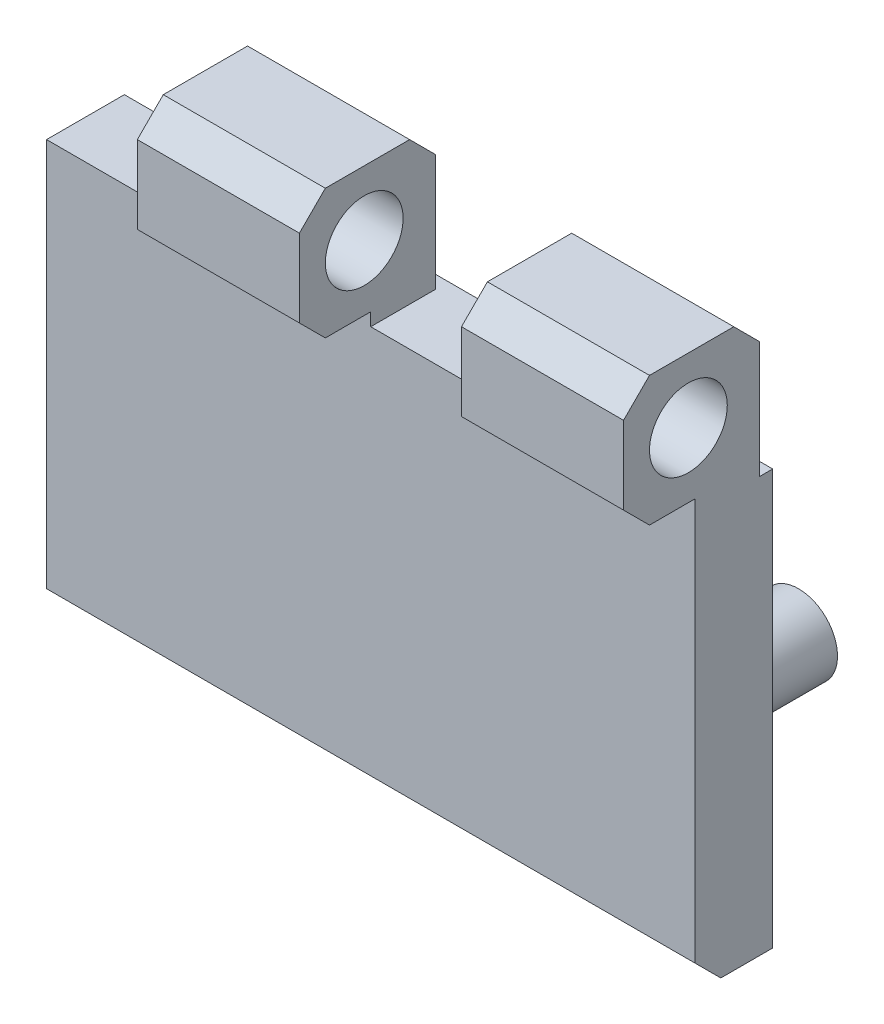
ISO-10303-21;
HEADER;
FILE_DESCRIPTION(('STEP AP214'),'2;1');
FILE_NAME('part.step','',(''),(''),'','','');
FILE_SCHEMA(('AUTOMOTIVE_DESIGN { 1 0 10303 214 1 1 1 1 }'));
ENDSEC;
DATA;
#1=APPLICATION_CONTEXT('core data for automotive mechanical design processes');
#2=APPLICATION_PROTOCOL_DEFINITION('international standard','automotive_design',2000,#1);
#3=PRODUCT_CONTEXT('',#1,'mechanical');
#4=PRODUCT('Part','Part','',(#3));
#5=PRODUCT_RELATED_PRODUCT_CATEGORY('part','',(#4));
#6=PRODUCT_DEFINITION_FORMATION('','',#4);
#7=PRODUCT_DEFINITION_CONTEXT('part definition',#1,'design');
#8=PRODUCT_DEFINITION('design','',#6,#7);
#9=PRODUCT_DEFINITION_SHAPE('','',#8);
#10=(LENGTH_UNIT() NAMED_UNIT(*) SI_UNIT(.MILLI.,.METRE.));
#11=(NAMED_UNIT(*) PLANE_ANGLE_UNIT() SI_UNIT($,.RADIAN.));
#12=(NAMED_UNIT(*) SI_UNIT($,.STERADIAN.) SOLID_ANGLE_UNIT());
#13=UNCERTAINTY_MEASURE_WITH_UNIT(LENGTH_MEASURE(1.E-05),#10,'distance_accuracy_value','');
#14=(GEOMETRIC_REPRESENTATION_CONTEXT(3) GLOBAL_UNCERTAINTY_ASSIGNED_CONTEXT((#13)) GLOBAL_UNIT_ASSIGNED_CONTEXT((#10,
#11,#12)) REPRESENTATION_CONTEXT('',''));
#15=CARTESIAN_POINT('',(0.,0.,0.));
#16=DIRECTION('',(0.,0.,1.));
#17=DIRECTION('',(1.,0.,0.));
#18=AXIS2_PLACEMENT_3D('',#15,#16,#17);
#19=CARTESIAN_POINT('',(-10.,-10.,0.));
#20=DIRECTION('',(0.,0.,-1.));
#21=DIRECTION('',(-1.,0.,0.));
#22=AXIS2_PLACEMENT_3D('',#19,#20,#21);
#23=PLANE('',#22);
#24=DIRECTION('',(0.,1.,0.));
#25=VECTOR('',#24,1.);
#26=CARTESIAN_POINT('',(-10.,-10.,0.));
#27=LINE('',#26,#25);
#28=CARTESIAN_POINT('',(-10.,-10.,0.));
#29=VERTEX_POINT('',#28);
#30=CARTESIAN_POINT('',(-10.,22.,0.));
#31=VERTEX_POINT('',#30);
#32=EDGE_CURVE('E315',#29,#31,#27,.T.);
#33=ORIENTED_EDGE('',*,*,#32,.T.);
#34=DIRECTION('',(1.,0.,0.));
#35=VECTOR('',#34,1.);
#36=CARTESIAN_POINT('',(-10.,22.,0.));
#37=LINE('',#36,#35);
#38=CARTESIAN_POINT('',(40.,22.,0.));
#39=VERTEX_POINT('',#38);
#40=EDGE_CURVE('E320',#31,#39,#37,.T.);
#41=ORIENTED_EDGE('',*,*,#40,.T.);
#42=DIRECTION('',(0.,1.,0.));
#43=VECTOR('',#42,1.);
#44=CARTESIAN_POINT('',(40.,-10.,0.));
#45=LINE('',#44,#43);
#46=CARTESIAN_POINT('',(40.,-10.,0.));
#47=VERTEX_POINT('',#46);
#48=EDGE_CURVE('E303',#47,#39,#45,.T.);
#49=ORIENTED_EDGE('',*,*,#48,.F.);
#50=DIRECTION('',(1.,0.,0.));
#51=VECTOR('',#50,1.);
#52=CARTESIAN_POINT('',(-10.,-10.,0.));
#53=LINE('',#52,#51);
#54=EDGE_CURVE('E318',#29,#47,#53,.T.);
#55=ORIENTED_EDGE('',*,*,#54,.F.);
#56=EDGE_LOOP('',(#33,#41,#49,#55));
#57=FACE_BOUND('',#56,.T.);
#58=CARTESIAN_POINT('',(30.,0.,0.));
#59=DIRECTION('',(0.,0.,-1.));
#60=DIRECTION('',(-1.,0.,0.));
#61=AXIS2_PLACEMENT_3D('',#58,#59,#60);
#62=CIRCLE('',#61,3.);
#63=CARTESIAN_POINT('',(27.,0.,0.));
#64=VERTEX_POINT('',#63);
#65=EDGE_CURVE('E10',#64,#64,#62,.T.);
#66=ORIENTED_EDGE('',*,*,#65,.F.);
#67=EDGE_LOOP('',(#66));
#68=FACE_BOUND('',#67,.T.);
#69=CARTESIAN_POINT('',(0.,0.,0.));
#70=DIRECTION('',(0.,0.,-1.));
#71=DIRECTION('',(-1.,0.,0.));
#72=AXIS2_PLACEMENT_3D('',#69,#70,#71);
#73=CIRCLE('',#72,3.);
#74=CARTESIAN_POINT('',(-3.,0.,0.));
#75=VERTEX_POINT('',#74);
#76=EDGE_CURVE('E234',#75,#75,#73,.T.);
#77=ORIENTED_EDGE('',*,*,#76,.F.);
#78=EDGE_LOOP('',(#77));
#79=FACE_BOUND('',#78,.T.);
#80=ADVANCED_FACE('F16',(#57,#68,#79),#23,.T.);
#81=CARTESIAN_POINT('',(-10.,-10.,6.));
#82=DIRECTION('',(0.,0.,-1.));
#83=DIRECTION('',(-1.,0.,0.));
#84=AXIS2_PLACEMENT_3D('',#81,#82,#83);
#85=PLANE('',#84);
#86=DIRECTION('',(0.,1.,0.));
#87=VECTOR('',#86,1.);
#88=CARTESIAN_POINT('',(27.5,-10.,6.));
#89=LINE('',#88,#87);
#90=CARTESIAN_POINT('',(27.5,22.,6.));
#91=VERTEX_POINT('',#90);
#92=CARTESIAN_POINT('',(27.5,23.,6.));
#93=VERTEX_POINT('',#92);
#94=EDGE_CURVE('E278',#91,#93,#89,.T.);
#95=ORIENTED_EDGE('',*,*,#94,.F.);
#96=DIRECTION('',(-1.,0.,0.));
#97=VECTOR('',#96,1.);
#98=CARTESIAN_POINT('',(-10.,22.,6.));
#99=LINE('',#98,#97);
#100=CARTESIAN_POINT('',(15.,22.,6.));
#101=VERTEX_POINT('',#100);
#102=EDGE_CURVE('E283',#91,#101,#99,.T.);
#103=ORIENTED_EDGE('',*,*,#102,.T.);
#104=DIRECTION('',(0.,1.,0.));
#105=VECTOR('',#104,1.);
#106=CARTESIAN_POINT('',(15.,-10.,6.));
#107=LINE('',#106,#105);
#108=CARTESIAN_POINT('',(15.,23.,6.));
#109=VERTEX_POINT('',#108);
#110=EDGE_CURVE('E268',#101,#109,#107,.T.);
#111=ORIENTED_EDGE('',*,*,#110,.T.);
#112=DIRECTION('',(1.,0.,0.));
#113=VECTOR('',#112,1.);
#114=CARTESIAN_POINT('',(-10.,23.,6.));
#115=LINE('',#114,#113);
#116=CARTESIAN_POINT('',(2.5,23.,6.));
#117=VERTEX_POINT('',#116);
#118=EDGE_CURVE('E327',#117,#109,#115,.T.);
#119=ORIENTED_EDGE('',*,*,#118,.F.);
#120=DIRECTION('',(0.,1.,0.));
#121=VECTOR('',#120,1.);
#122=CARTESIAN_POINT('',(2.5,-10.,6.));
#123=LINE('',#122,#121);
#124=CARTESIAN_POINT('',(2.5,22.,6.));
#125=VERTEX_POINT('',#124);
#126=EDGE_CURVE('E261',#125,#117,#123,.T.);
#127=ORIENTED_EDGE('',*,*,#126,.F.);
#128=DIRECTION('',(-1.,0.,0.));
#129=VECTOR('',#128,1.);
#130=CARTESIAN_POINT('',(-10.,22.,6.));
#131=LINE('',#130,#129);
#132=CARTESIAN_POINT('',(-10.,22.,6.));
#133=VERTEX_POINT('',#132);
#134=EDGE_CURVE('E280',#125,#133,#131,.T.);
#135=ORIENTED_EDGE('',*,*,#134,.T.);
#136=DIRECTION('',(0.,1.,0.));
#137=VECTOR('',#136,1.);
#138=CARTESIAN_POINT('',(-10.,-10.,6.));
#139=LINE('',#138,#137);
#140=CARTESIAN_POINT('',(-10.,-8.,6.));
#141=VERTEX_POINT('',#140);
#142=EDGE_CURVE('E309',#141,#133,#139,.T.);
#143=ORIENTED_EDGE('',*,*,#142,.F.);
#144=DIRECTION('',(1.,0.,0.));
#145=VECTOR('',#144,1.);
#146=CARTESIAN_POINT('',(-10.,-8.,6.));
#147=LINE('',#146,#145);
#148=CARTESIAN_POINT('',(40.,-8.,6.));
#149=VERTEX_POINT('',#148);
#150=EDGE_CURVE('E328',#141,#149,#147,.T.);
#151=ORIENTED_EDGE('',*,*,#150,.T.);
#152=DIRECTION('',(0.,1.,0.));
#153=VECTOR('',#152,1.);
#154=CARTESIAN_POINT('',(40.,-10.,6.));
#155=LINE('',#154,#153);
#156=CARTESIAN_POINT('',(40.,23.,6.));
#157=VERTEX_POINT('',#156);
#158=EDGE_CURVE('E289',#149,#157,#155,.T.);
#159=ORIENTED_EDGE('',*,*,#158,.T.);
#160=EDGE_CURVE('E325',#93,#157,#115,.T.);
#161=ORIENTED_EDGE('',*,*,#160,.F.);
#162=EDGE_LOOP('',(#95,#103,#111,#119,#127,#135,#143,#151,#159,#161));
#163=FACE_BOUND('',#162,.T.);
#164=ADVANCED_FACE('F18',(#163),#85,.F.);
#165=CARTESIAN_POINT('',(-10.,23.,11.));
#166=DIRECTION('',(0.,-1.,0.));
#167=DIRECTION('',(1.,0.,0.));
#168=AXIS2_PLACEMENT_3D('',#165,#166,#167);
#169=PLANE('',#168);
#170=DIRECTION('',(0.,0.,-1.));
#171=VECTOR('',#170,1.);
#172=CARTESIAN_POINT('',(40.,23.,11.));
#173=LINE('',#172,#171);
#174=CARTESIAN_POINT('',(40.,23.,9.5));
#175=VERTEX_POINT('',#174);
#176=EDGE_CURVE('E292',#175,#157,#173,.T.);
#177=ORIENTED_EDGE('',*,*,#176,.F.);
#178=DIRECTION('',(1.,0.,0.));
#179=VECTOR('',#178,1.);
#180=CARTESIAN_POINT('',(27.5,23.,9.5));
#181=LINE('',#180,#179);
#182=CARTESIAN_POINT('',(27.5,23.,9.5));
#183=VERTEX_POINT('',#182);
#184=EDGE_CURVE('E231',#183,#175,#181,.T.);
#185=ORIENTED_EDGE('',*,*,#184,.F.);
#186=DIRECTION('',(0.,0.,-1.));
#187=VECTOR('',#186,1.);
#188=CARTESIAN_POINT('',(27.5,23.,11.));
#189=LINE('',#188,#187);
#190=EDGE_CURVE('E275',#183,#93,#189,.T.);
#191=ORIENTED_EDGE('',*,*,#190,.T.);
#192=ORIENTED_EDGE('',*,*,#160,.T.);
#193=EDGE_LOOP('',(#177,#185,#191,#192));
#194=FACE_BOUND('',#193,.T.);
#195=ADVANCED_FACE('F382',(#194),#169,.T.);
#196=DIRECTION('',(0.,0.,-1.));
#197=VECTOR('',#196,1.);
#198=CARTESIAN_POINT('',(15.,23.,11.));
#199=LINE('',#198,#197);
#200=CARTESIAN_POINT('',(15.,23.,9.5));
#201=VERTEX_POINT('',#200);
#202=EDGE_CURVE('E266',#201,#109,#199,.T.);
#203=ORIENTED_EDGE('',*,*,#202,.F.);
#204=DIRECTION('',(1.,0.,0.));
#205=VECTOR('',#204,1.);
#206=CARTESIAN_POINT('',(2.5,23.,9.5));
#207=LINE('',#206,#205);
#208=CARTESIAN_POINT('',(2.5,23.,9.5));
#209=VERTEX_POINT('',#208);
#210=EDGE_CURVE('E206',#209,#201,#207,.T.);
#211=ORIENTED_EDGE('',*,*,#210,.F.);
#212=DIRECTION('',(0.,0.,-1.));
#213=VECTOR('',#212,1.);
#214=CARTESIAN_POINT('',(2.5,23.,11.));
#215=LINE('',#214,#213);
#216=EDGE_CURVE('E174',#209,#117,#215,.T.);
#217=ORIENTED_EDGE('',*,*,#216,.T.);
#218=ORIENTED_EDGE('',*,*,#118,.T.);
#219=EDGE_LOOP('',(#203,#211,#217,#218));
#220=FACE_BOUND('',#219,.T.);
#221=ADVANCED_FACE('F432',(#220),#169,.T.);
#222=CARTESIAN_POINT('',(-10.,33.,1.));
#223=DIRECTION('',(0.,1.,0.));
#224=DIRECTION('',(-1.,0.,0.));
#225=AXIS2_PLACEMENT_3D('',#222,#223,#224);
#226=PLANE('',#225);
#227=DIRECTION('',(-1.,0.,0.));
#228=VECTOR('',#227,1.);
#229=CARTESIAN_POINT('',(-10.,33.,3.));
#230=LINE('',#229,#228);
#231=CARTESIAN_POINT('',(40.,33.,3.));
#232=VERTEX_POINT('',#231);
#233=CARTESIAN_POINT('',(27.5,33.,3.));
#234=VERTEX_POINT('',#233);
#235=EDGE_CURVE('E339',#232,#234,#230,.T.);
#236=ORIENTED_EDGE('',*,*,#235,.T.);
#237=DIRECTION('',(0.,0.,1.));
#238=VECTOR('',#237,1.);
#239=CARTESIAN_POINT('',(27.5,33.,1.));
#240=LINE('',#239,#238);
#241=CARTESIAN_POINT('',(27.5,33.,9.5));
#242=VERTEX_POINT('',#241);
#243=EDGE_CURVE('E273',#234,#242,#240,.T.);
#244=ORIENTED_EDGE('',*,*,#243,.T.);
#245=DIRECTION('',(1.,0.,0.));
#246=VECTOR('',#245,1.);
#247=CARTESIAN_POINT('',(27.5,33.,9.5));
#248=LINE('',#247,#246);
#249=CARTESIAN_POINT('',(40.,33.,9.5));
#250=VERTEX_POINT('',#249);
#251=EDGE_CURVE('E223',#242,#250,#248,.T.);
#252=ORIENTED_EDGE('',*,*,#251,.T.);
#253=DIRECTION('',(0.,0.,1.));
#254=VECTOR('',#253,1.);
#255=CARTESIAN_POINT('',(40.,33.,1.));
#256=LINE('',#255,#254);
#257=EDGE_CURVE('E295',#232,#250,#256,.T.);
#258=ORIENTED_EDGE('',*,*,#257,.F.);
#259=EDGE_LOOP('',(#236,#244,#252,#258));
#260=FACE_BOUND('',#259,.T.);
#261=ADVANCED_FACE('F358',(#260),#226,.T.);
#262=DIRECTION('',(0.,0.,1.));
#263=VECTOR('',#262,1.);
#264=CARTESIAN_POINT('',(15.,33.,1.));
#265=LINE('',#264,#263);
#266=CARTESIAN_POINT('',(15.,33.,3.));
#267=VERTEX_POINT('',#266);
#268=CARTESIAN_POINT('',(15.,33.,9.5));
#269=VERTEX_POINT('',#268);
#270=EDGE_CURVE('E264',#267,#269,#265,.T.);
#271=ORIENTED_EDGE('',*,*,#270,.F.);
#272=CARTESIAN_POINT('',(2.5,33.,3.));
#273=VERTEX_POINT('',#272);
#274=EDGE_CURVE('E173',#267,#273,#230,.T.);
#275=ORIENTED_EDGE('',*,*,#274,.T.);
#276=DIRECTION('',(0.,0.,1.));
#277=VECTOR('',#276,1.);
#278=CARTESIAN_POINT('',(2.5,33.,1.));
#279=LINE('',#278,#277);
#280=CARTESIAN_POINT('',(2.5,33.,9.5));
#281=VERTEX_POINT('',#280);
#282=EDGE_CURVE('E41',#273,#281,#279,.T.);
#283=ORIENTED_EDGE('',*,*,#282,.T.);
#284=DIRECTION('',(1.,0.,0.));
#285=VECTOR('',#284,1.);
#286=CARTESIAN_POINT('',(2.5,33.,9.5));
#287=LINE('',#286,#285);
#288=EDGE_CURVE('E170',#281,#269,#287,.T.);
#289=ORIENTED_EDGE('',*,*,#288,.T.);
#290=EDGE_LOOP('',(#271,#275,#283,#289));
#291=FACE_BOUND('',#290,.T.);
#292=ADVANCED_FACE('F169',(#291),#226,.T.);
#293=CARTESIAN_POINT('',(-10.,33.,1.));
#294=DIRECTION('',(0.,0.,1.));
#295=DIRECTION('',(0.,-1.,0.));
#296=AXIS2_PLACEMENT_3D('',#293,#294,#295);
#297=PLANE('',#296);
#298=DIRECTION('',(0.,-1.,0.));
#299=VECTOR('',#298,1.);
#300=CARTESIAN_POINT('',(27.5,33.,1.));
#301=LINE('',#300,#299);
#302=CARTESIAN_POINT('',(27.5,31.,1.));
#303=VERTEX_POINT('',#302);
#304=CARTESIAN_POINT('',(27.5,22.,1.));
#305=VERTEX_POINT('',#304);
#306=EDGE_CURVE('E271',#303,#305,#301,.T.);
#307=ORIENTED_EDGE('',*,*,#306,.F.);
#308=DIRECTION('',(1.,0.,0.));
#309=VECTOR('',#308,1.);
#310=CARTESIAN_POINT('',(40.,31.,1.));
#311=LINE('',#310,#309);
#312=CARTESIAN_POINT('',(40.,31.,1.));
#313=VERTEX_POINT('',#312);
#314=EDGE_CURVE('E342',#303,#313,#311,.T.);
#315=ORIENTED_EDGE('',*,*,#314,.T.);
#316=DIRECTION('',(0.,-1.,0.));
#317=VECTOR('',#316,1.);
#318=CARTESIAN_POINT('',(40.,33.,1.));
#319=LINE('',#318,#317);
#320=CARTESIAN_POINT('',(40.,22.,1.));
#321=VERTEX_POINT('',#320);
#322=EDGE_CURVE('E297',#313,#321,#319,.T.);
#323=ORIENTED_EDGE('',*,*,#322,.T.);
#324=DIRECTION('',(1.,0.,0.));
#325=VECTOR('',#324,1.);
#326=CARTESIAN_POINT('',(-10.,22.,1.));
#327=LINE('',#326,#325);
#328=EDGE_CURVE('E322',#305,#321,#327,.T.);
#329=ORIENTED_EDGE('',*,*,#328,.F.);
#330=EDGE_LOOP('',(#307,#315,#323,#329));
#331=FACE_BOUND('',#330,.T.);
#332=ADVANCED_FACE('F367',(#331),#297,.F.);
#333=CARTESIAN_POINT('',(2.5,31.,1.));
#334=VERTEX_POINT('',#333);
#335=CARTESIAN_POINT('',(15.,31.,1.));
#336=VERTEX_POINT('',#335);
#337=EDGE_CURVE('E344',#334,#336,#311,.T.);
#338=ORIENTED_EDGE('',*,*,#337,.T.);
#339=DIRECTION('',(0.,-1.,0.));
#340=VECTOR('',#339,1.);
#341=CARTESIAN_POINT('',(15.,33.,1.));
#342=LINE('',#341,#340);
#343=CARTESIAN_POINT('',(15.,22.,1.));
#344=VERTEX_POINT('',#343);
#345=EDGE_CURVE('E33',#336,#344,#342,.T.);
#346=ORIENTED_EDGE('',*,*,#345,.T.);
#347=CARTESIAN_POINT('',(2.5,22.,1.));
#348=VERTEX_POINT('',#347);
#349=EDGE_CURVE('E324',#348,#344,#327,.T.);
#350=ORIENTED_EDGE('',*,*,#349,.F.);
#351=DIRECTION('',(0.,-1.,0.));
#352=VECTOR('',#351,1.);
#353=CARTESIAN_POINT('',(2.5,33.,1.));
#354=LINE('',#353,#352);
#355=EDGE_CURVE('E175',#334,#348,#354,.T.);
#356=ORIENTED_EDGE('',*,*,#355,.F.);
#357=EDGE_LOOP('',(#338,#346,#350,#356));
#358=FACE_BOUND('',#357,.T.);
#359=ADVANCED_FACE('F430',(#358),#297,.F.);
#360=CARTESIAN_POINT('',(-10.,31.,1.));
#361=DIRECTION('',(0.,0.707106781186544,-0.707106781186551));
#362=DIRECTION('',(0.,0.707106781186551,0.707106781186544));
#363=AXIS2_PLACEMENT_3D('',#360,#361,#362);
#364=PLANE('',#363);
#365=ORIENTED_EDGE('',*,*,#314,.F.);
#366=DIRECTION('',(0.,0.707106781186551,0.707106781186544));
#367=VECTOR('',#366,1.);
#368=CARTESIAN_POINT('',(27.5,31.,1.));
#369=LINE('',#368,#367);
#370=EDGE_CURVE('E25',#303,#234,#369,.T.);
#371=ORIENTED_EDGE('',*,*,#370,.T.);
#372=ORIENTED_EDGE('',*,*,#235,.F.);
#373=DIRECTION('',(0.,0.707106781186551,0.707106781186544));
#374=VECTOR('',#373,1.);
#375=CARTESIAN_POINT('',(40.,31.,1.));
#376=LINE('',#375,#374);
#377=EDGE_CURVE('E331',#313,#232,#376,.T.);
#378=ORIENTED_EDGE('',*,*,#377,.F.);
#379=EDGE_LOOP('',(#365,#371,#372,#378));
#380=FACE_BOUND('',#379,.T.);
#381=ADVANCED_FACE('F352',(#380),#364,.T.);
#382=DIRECTION('',(0.,0.707106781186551,0.707106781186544));
#383=VECTOR('',#382,1.);
#384=CARTESIAN_POINT('',(15.,31.,1.));
#385=LINE('',#384,#383);
#386=EDGE_CURVE('E347',#336,#267,#385,.T.);
#387=ORIENTED_EDGE('',*,*,#386,.F.);
#388=ORIENTED_EDGE('',*,*,#337,.F.);
#389=DIRECTION('',(0.,0.707106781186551,0.707106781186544));
#390=VECTOR('',#389,1.);
#391=CARTESIAN_POINT('',(2.5,31.,1.));
#392=LINE('',#391,#390);
#393=EDGE_CURVE('E345',#334,#273,#392,.T.);
#394=ORIENTED_EDGE('',*,*,#393,.T.);
#395=ORIENTED_EDGE('',*,*,#274,.F.);
#396=EDGE_LOOP('',(#387,#388,#394,#395));
#397=FACE_BOUND('',#396,.T.);
#398=ADVANCED_FACE('F458',(#397),#364,.T.);
#399=CARTESIAN_POINT('',(-10.,-10.,0.));
#400=DIRECTION('',(0.,1.,0.));
#401=DIRECTION('',(-1.,0.,0.));
#402=AXIS2_PLACEMENT_3D('',#399,#400,#401);
#403=PLANE('',#402);
#404=DIRECTION('',(0.,0.,1.));
#405=VECTOR('',#404,1.);
#406=CARTESIAN_POINT('',(40.,-10.,0.));
#407=LINE('',#406,#405);
#408=CARTESIAN_POINT('',(40.,-10.,4.));
#409=VERTEX_POINT('',#408);
#410=EDGE_CURVE('E286',#47,#409,#407,.T.);
#411=ORIENTED_EDGE('',*,*,#410,.T.);
#412=DIRECTION('',(-1.,0.,0.));
#413=VECTOR('',#412,1.);
#414=CARTESIAN_POINT('',(-10.,-10.,4.));
#415=LINE('',#414,#413);
#416=CARTESIAN_POINT('',(-10.,-10.,4.));
#417=VERTEX_POINT('',#416);
#418=EDGE_CURVE('E335',#409,#417,#415,.T.);
#419=ORIENTED_EDGE('',*,*,#418,.T.);
#420=DIRECTION('',(0.,0.,1.));
#421=VECTOR('',#420,1.);
#422=CARTESIAN_POINT('',(-10.,-10.,0.));
#423=LINE('',#422,#421);
#424=EDGE_CURVE('E306',#29,#417,#423,.T.);
#425=ORIENTED_EDGE('',*,*,#424,.F.);
#426=ORIENTED_EDGE('',*,*,#54,.T.);
#427=EDGE_LOOP('',(#411,#419,#425,#426));
#428=FACE_BOUND('',#427,.T.);
#429=ADVANCED_FACE('F402',(#428),#403,.F.);
#430=CARTESIAN_POINT('',(-10.,22.,1.));
#431=DIRECTION('',(0.,-1.,0.));
#432=DIRECTION('',(0.,0.,-1.));
#433=AXIS2_PLACEMENT_3D('',#430,#431,#432);
#434=PLANE('',#433);
#435=DIRECTION('',(0.,0.,-1.));
#436=VECTOR('',#435,1.);
#437=CARTESIAN_POINT('',(-10.,22.,1.));
#438=LINE('',#437,#436);
#439=EDGE_CURVE('E312',#133,#31,#438,.T.);
#440=ORIENTED_EDGE('',*,*,#439,.F.);
#441=ORIENTED_EDGE('',*,*,#134,.F.);
#442=DIRECTION('',(0.,0.,1.));
#443=VECTOR('',#442,1.);
#444=CARTESIAN_POINT('',(2.5,22.,-9.));
#445=LINE('',#444,#443);
#446=EDGE_CURVE('E249',#348,#125,#445,.T.);
#447=ORIENTED_EDGE('',*,*,#446,.F.);
#448=ORIENTED_EDGE('',*,*,#349,.T.);
#449=DIRECTION('',(0.,0.,1.));
#450=VECTOR('',#449,1.);
#451=CARTESIAN_POINT('',(15.,22.,-9.));
#452=LINE('',#451,#450);
#453=EDGE_CURVE('E252',#344,#101,#452,.T.);
#454=ORIENTED_EDGE('',*,*,#453,.T.);
#455=ORIENTED_EDGE('',*,*,#102,.F.);
#456=DIRECTION('',(0.,0.,1.));
#457=VECTOR('',#456,1.);
#458=CARTESIAN_POINT('',(27.5,22.,-9.));
#459=LINE('',#458,#457);
#460=EDGE_CURVE('E255',#305,#91,#459,.T.);
#461=ORIENTED_EDGE('',*,*,#460,.F.);
#462=ORIENTED_EDGE('',*,*,#328,.T.);
#463=DIRECTION('',(0.,0.,-1.));
#464=VECTOR('',#463,1.);
#465=CARTESIAN_POINT('',(40.,22.,1.));
#466=LINE('',#465,#464);
#467=EDGE_CURVE('E300',#321,#39,#466,.T.);
#468=ORIENTED_EDGE('',*,*,#467,.T.);
#469=ORIENTED_EDGE('',*,*,#40,.F.);
#470=EDGE_LOOP('',(#440,#441,#447,#448,#454,#455,#461,#462,#468,#469));
#471=FACE_BOUND('',#470,.T.);
#472=ADVANCED_FACE('F373',(#471),#434,.F.);
#473=CARTESIAN_POINT('',(-10.,-10.,6.));
#474=DIRECTION('',(-1.,0.,0.));
#475=DIRECTION('',(0.,-1.,0.));
#476=AXIS2_PLACEMENT_3D('',#473,#474,#475);
#477=PLANE('',#476);
#478=ORIENTED_EDGE('',*,*,#142,.T.);
#479=ORIENTED_EDGE('',*,*,#439,.T.);
#480=ORIENTED_EDGE('',*,*,#32,.F.);
#481=ORIENTED_EDGE('',*,*,#424,.T.);
#482=DIRECTION('',(0.,-0.707106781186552,-0.707106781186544));
#483=VECTOR('',#482,1.);
#484=CARTESIAN_POINT('',(-10.,-9.,5.));
#485=LINE('',#484,#483);
#486=EDGE_CURVE('E337',#417,#141,#485,.F.);
#487=ORIENTED_EDGE('',*,*,#486,.T.);
#488=EDGE_LOOP('',(#478,#479,#480,#481,#487));
#489=FACE_BOUND('',#488,.T.);
#490=ADVANCED_FACE('F408',(#489),#477,.T.);
#491=CARTESIAN_POINT('',(40.,-10.,6.));
#492=DIRECTION('',(-1.,0.,0.));
#493=DIRECTION('',(0.,-1.,0.));
#494=AXIS2_PLACEMENT_3D('',#491,#492,#493);
#495=PLANE('',#494);
#496=CARTESIAN_POINT('',(40.,28.,6.5));
#497=DIRECTION('',(1.,0.,0.));
#498=DIRECTION('',(0.,0.,-1.));
#499=AXIS2_PLACEMENT_3D('',#496,#497,#498);
#500=CIRCLE('',#499,3.);
#501=CARTESIAN_POINT('',(40.,28.,3.5));
#502=VERTEX_POINT('',#501);
#503=EDGE_CURVE('E535',#502,#502,#500,.T.);
#504=ORIENTED_EDGE('',*,*,#503,.F.);
#505=EDGE_LOOP('',(#504));
#506=FACE_BOUND('',#505,.T.);
#507=ORIENTED_EDGE('',*,*,#257,.T.);
#508=DIRECTION('',(0.,-0.707106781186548,0.707106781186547));
#509=VECTOR('',#508,1.);
#510=CARTESIAN_POINT('',(40.,33.,9.5));
#511=LINE('',#510,#509);
#512=CARTESIAN_POINT('',(40.,31.,11.5));
#513=VERTEX_POINT('',#512);
#514=EDGE_CURVE('E209',#250,#513,#511,.T.);
#515=ORIENTED_EDGE('',*,*,#514,.T.);
#516=DIRECTION('',(0.,-1.,0.));
#517=VECTOR('',#516,1.);
#518=CARTESIAN_POINT('',(40.,25.,11.5));
#519=LINE('',#518,#517);
#520=CARTESIAN_POINT('',(40.,25.,11.5));
#521=VERTEX_POINT('',#520);
#522=EDGE_CURVE('E226',#513,#521,#519,.T.);
#523=ORIENTED_EDGE('',*,*,#522,.T.);
#524=DIRECTION('',(0.,-0.707106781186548,-0.707106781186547));
#525=VECTOR('',#524,1.);
#526=CARTESIAN_POINT('',(40.,25.,11.5));
#527=LINE('',#526,#525);
#528=EDGE_CURVE('E217',#521,#175,#527,.T.);
#529=ORIENTED_EDGE('',*,*,#528,.T.);
#530=ORIENTED_EDGE('',*,*,#176,.T.);
#531=ORIENTED_EDGE('',*,*,#158,.F.);
#532=DIRECTION('',(0.,0.707106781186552,0.707106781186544));
#533=VECTOR('',#532,1.);
#534=CARTESIAN_POINT('',(40.,-8.,6.));
#535=LINE('',#534,#533);
#536=EDGE_CURVE('E333',#149,#409,#535,.F.);
#537=ORIENTED_EDGE('',*,*,#536,.T.);
#538=ORIENTED_EDGE('',*,*,#410,.F.);
#539=ORIENTED_EDGE('',*,*,#48,.T.);
#540=ORIENTED_EDGE('',*,*,#467,.F.);
#541=ORIENTED_EDGE('',*,*,#322,.F.);
#542=ORIENTED_EDGE('',*,*,#377,.T.);
#543=EDGE_LOOP('',(#507,#515,#523,#529,#530,#531,#537,#538,#539,#540,#541,#542));
#544=FACE_BOUND('',#543,.T.);
#545=ADVANCED_FACE('F362',(#506,#544),#495,.F.);
#546=CARTESIAN_POINT('',(-10.,-8.,6.));
#547=DIRECTION('',(0.,0.707106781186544,-0.707106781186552));
#548=DIRECTION('',(0.,0.707106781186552,0.707106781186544));
#549=AXIS2_PLACEMENT_3D('',#546,#547,#548);
#550=PLANE('',#549);
#551=ORIENTED_EDGE('',*,*,#486,.F.);
#552=ORIENTED_EDGE('',*,*,#418,.F.);
#553=ORIENTED_EDGE('',*,*,#536,.F.);
#554=ORIENTED_EDGE('',*,*,#150,.F.);
#555=EDGE_LOOP('',(#551,#552,#553,#554));
#556=FACE_BOUND('',#555,.T.);
#557=ADVANCED_FACE('F397',(#556),#550,.F.);
#558=CARTESIAN_POINT('',(2.5,48.,-9.));
#559=DIRECTION('',(-1.,0.,0.));
#560=DIRECTION('',(0.,-1.,0.));
#561=AXIS2_PLACEMENT_3D('',#558,#559,#560);
#562=PLANE('',#561);
#563=CARTESIAN_POINT('',(2.5,28.,6.5));
#564=DIRECTION('',(-1.,0.,0.));
#565=DIRECTION('',(0.,0.,1.));
#566=AXIS2_PLACEMENT_3D('',#563,#564,#565);
#567=CIRCLE('',#566,3.);
#568=CARTESIAN_POINT('',(2.5,28.,9.5));
#569=VERTEX_POINT('',#568);
#570=EDGE_CURVE('E198',#569,#569,#567,.T.);
#571=ORIENTED_EDGE('',*,*,#570,.F.);
#572=EDGE_LOOP('',(#571));
#573=FACE_BOUND('',#572,.T.);
#574=DIRECTION('',(0.,-0.707106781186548,0.707106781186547));
#575=VECTOR('',#574,1.);
#576=CARTESIAN_POINT('',(2.5,33.,9.5));
#577=LINE('',#576,#575);
#578=CARTESIAN_POINT('',(2.5,31.,11.5));
#579=VERTEX_POINT('',#578);
#580=EDGE_CURVE('E180',#281,#579,#577,.T.);
#581=ORIENTED_EDGE('',*,*,#580,.F.);
#582=ORIENTED_EDGE('',*,*,#282,.F.);
#583=ORIENTED_EDGE('',*,*,#393,.F.);
#584=ORIENTED_EDGE('',*,*,#355,.T.);
#585=ORIENTED_EDGE('',*,*,#446,.T.);
#586=ORIENTED_EDGE('',*,*,#126,.T.);
#587=ORIENTED_EDGE('',*,*,#216,.F.);
#588=DIRECTION('',(0.,-0.707106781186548,-0.707106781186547));
#589=VECTOR('',#588,1.);
#590=CARTESIAN_POINT('',(2.5,25.,11.5));
#591=LINE('',#590,#589);
#592=CARTESIAN_POINT('',(2.5,25.,11.5));
#593=VERTEX_POINT('',#592);
#594=EDGE_CURVE('E184',#593,#209,#591,.T.);
#595=ORIENTED_EDGE('',*,*,#594,.F.);
#596=DIRECTION('',(0.,-1.,0.));
#597=VECTOR('',#596,1.);
#598=CARTESIAN_POINT('',(2.5,31.,11.5));
#599=LINE('',#598,#597);
#600=EDGE_CURVE('E190',#579,#593,#599,.T.);
#601=ORIENTED_EDGE('',*,*,#600,.F.);
#602=EDGE_LOOP('',(#581,#582,#583,#584,#585,#586,#587,#595,#601));
#603=FACE_BOUND('',#602,.T.);
#604=ADVANCED_FACE('F187',(#573,#603),#562,.T.);
#605=CARTESIAN_POINT('',(27.5,48.,-9.));
#606=DIRECTION('',(-1.,0.,0.));
#607=DIRECTION('',(0.,-1.,0.));
#608=AXIS2_PLACEMENT_3D('',#605,#606,#607);
#609=PLANE('',#608);
#610=CARTESIAN_POINT('',(27.5,28.,6.5));
#611=DIRECTION('',(-1.,0.,0.));
#612=DIRECTION('',(0.,0.,1.));
#613=AXIS2_PLACEMENT_3D('',#610,#611,#612);
#614=CIRCLE('',#613,3.);
#615=CARTESIAN_POINT('',(27.5,28.,9.5));
#616=VERTEX_POINT('',#615);
#617=EDGE_CURVE('E532',#616,#616,#614,.T.);
#618=ORIENTED_EDGE('',*,*,#617,.F.);
#619=EDGE_LOOP('',(#618));
#620=FACE_BOUND('',#619,.T.);
#621=DIRECTION('',(0.,-0.707106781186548,0.707106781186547));
#622=VECTOR('',#621,1.);
#623=CARTESIAN_POINT('',(27.5,33.,9.5));
#624=LINE('',#623,#622);
#625=CARTESIAN_POINT('',(27.5,31.,11.5));
#626=VERTEX_POINT('',#625);
#627=EDGE_CURVE('E213',#242,#626,#624,.T.);
#628=ORIENTED_EDGE('',*,*,#627,.F.);
#629=ORIENTED_EDGE('',*,*,#243,.F.);
#630=ORIENTED_EDGE('',*,*,#370,.F.);
#631=ORIENTED_EDGE('',*,*,#306,.T.);
#632=ORIENTED_EDGE('',*,*,#460,.T.);
#633=ORIENTED_EDGE('',*,*,#94,.T.);
#634=ORIENTED_EDGE('',*,*,#190,.F.);
#635=DIRECTION('',(0.,-0.707106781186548,-0.707106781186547));
#636=VECTOR('',#635,1.);
#637=CARTESIAN_POINT('',(27.5,25.,11.5));
#638=LINE('',#637,#636);
#639=CARTESIAN_POINT('',(27.5,25.,11.5));
#640=VERTEX_POINT('',#639);
#641=EDGE_CURVE('E220',#640,#183,#638,.T.);
#642=ORIENTED_EDGE('',*,*,#641,.F.);
#643=DIRECTION('',(0.,-1.,0.));
#644=VECTOR('',#643,1.);
#645=CARTESIAN_POINT('',(27.5,25.,11.5));
#646=LINE('',#645,#644);
#647=EDGE_CURVE('E216',#626,#640,#646,.T.);
#648=ORIENTED_EDGE('',*,*,#647,.F.);
#649=EDGE_LOOP('',(#628,#629,#630,#631,#632,#633,#634,#642,#648));
#650=FACE_BOUND('',#649,.T.);
#651=ADVANCED_FACE('F370',(#620,#650),#609,.T.);
#652=CARTESIAN_POINT('',(15.,48.,-9.));
#653=DIRECTION('',(-1.,0.,0.));
#654=DIRECTION('',(0.,-1.,0.));
#655=AXIS2_PLACEMENT_3D('',#652,#653,#654);
#656=PLANE('',#655);
#657=CARTESIAN_POINT('',(15.,28.,6.5));
#658=DIRECTION('',(-1.,0.,0.));
#659=DIRECTION('',(0.,0.,1.));
#660=AXIS2_PLACEMENT_3D('',#657,#658,#659);
#661=CIRCLE('',#660,3.);
#662=CARTESIAN_POINT('',(15.,28.,9.5));
#663=VERTEX_POINT('',#662);
#664=EDGE_CURVE('E20',#663,#663,#661,.T.);
#665=ORIENTED_EDGE('',*,*,#664,.T.);
#666=EDGE_LOOP('',(#665));
#667=FACE_BOUND('',#666,.T.);
#668=ORIENTED_EDGE('',*,*,#270,.T.);
#669=DIRECTION('',(0.,-0.707106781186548,0.707106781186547));
#670=VECTOR('',#669,1.);
#671=CARTESIAN_POINT('',(15.,33.,9.5));
#672=LINE('',#671,#670);
#673=CARTESIAN_POINT('',(15.,31.,11.5));
#674=VERTEX_POINT('',#673);
#675=EDGE_CURVE('E182',#269,#674,#672,.T.);
#676=ORIENTED_EDGE('',*,*,#675,.T.);
#677=DIRECTION('',(0.,-1.,0.));
#678=VECTOR('',#677,1.);
#679=CARTESIAN_POINT('',(15.,31.,11.5));
#680=LINE('',#679,#678);
#681=CARTESIAN_POINT('',(15.,25.,11.5));
#682=VERTEX_POINT('',#681);
#683=EDGE_CURVE('E195',#674,#682,#680,.T.);
#684=ORIENTED_EDGE('',*,*,#683,.T.);
#685=DIRECTION('',(0.,-0.707106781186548,-0.707106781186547));
#686=VECTOR('',#685,1.);
#687=CARTESIAN_POINT('',(15.,25.,11.5));
#688=LINE('',#687,#686);
#689=EDGE_CURVE('E191',#682,#201,#688,.T.);
#690=ORIENTED_EDGE('',*,*,#689,.T.);
#691=ORIENTED_EDGE('',*,*,#202,.T.);
#692=ORIENTED_EDGE('',*,*,#110,.F.);
#693=ORIENTED_EDGE('',*,*,#453,.F.);
#694=ORIENTED_EDGE('',*,*,#345,.F.);
#695=ORIENTED_EDGE('',*,*,#386,.T.);
#696=EDGE_LOOP('',(#668,#676,#684,#690,#691,#692,#693,#694,#695));
#697=FACE_BOUND('',#696,.T.);
#698=ADVANCED_FACE('F446',(#667,#697),#656,.F.);
#699=CARTESIAN_POINT('',(30.,0.,-12.));
#700=DIRECTION('',(0.,0.,1.));
#701=DIRECTION('',(1.,0.,0.));
#702=AXIS2_PLACEMENT_3D('',#699,#700,#701);
#703=CYLINDRICAL_SURFACE('',#702,3.);
#704=CARTESIAN_POINT('',(30.,0.,-12.));
#705=DIRECTION('',(0.,0.,-1.));
#706=DIRECTION('',(-1.,0.,0.));
#707=AXIS2_PLACEMENT_3D('',#704,#705,#706);
#708=CIRCLE('',#707,3.);
#709=CARTESIAN_POINT('',(27.,0.,-12.));
#710=VERTEX_POINT('',#709);
#711=EDGE_CURVE('E245',#710,#710,#708,.T.);
#712=ORIENTED_EDGE('',*,*,#711,.F.);
#713=EDGE_LOOP('',(#712));
#714=FACE_BOUND('',#713,.T.);
#715=ORIENTED_EDGE('',*,*,#65,.T.);
#716=EDGE_LOOP('',(#715));
#717=FACE_BOUND('',#716,.T.);
#718=ADVANCED_FACE('F483',(#714,#717),#703,.T.);
#719=CARTESIAN_POINT('',(30.,0.,-12.));
#720=DIRECTION('',(0.,0.,-1.));
#721=DIRECTION('',(-1.,0.,0.));
#722=AXIS2_PLACEMENT_3D('',#719,#720,#721);
#723=PLANE('',#722);
#724=ORIENTED_EDGE('',*,*,#711,.T.);
#725=EDGE_LOOP('',(#724));
#726=FACE_BOUND('',#725,.T.);
#727=ADVANCED_FACE('F487',(#726),#723,.T.);
#728=CARTESIAN_POINT('',(0.,0.,-12.));
#729=DIRECTION('',(0.,0.,1.));
#730=DIRECTION('',(1.,0.,0.));
#731=AXIS2_PLACEMENT_3D('',#728,#729,#730);
#732=CYLINDRICAL_SURFACE('',#731,3.);
#733=CARTESIAN_POINT('',(0.,0.,-12.));
#734=DIRECTION('',(0.,0.,-1.));
#735=DIRECTION('',(-1.,0.,0.));
#736=AXIS2_PLACEMENT_3D('',#733,#734,#735);
#737=CIRCLE('',#736,3.);
#738=CARTESIAN_POINT('',(-3.,0.,-12.));
#739=VERTEX_POINT('',#738);
#740=EDGE_CURVE('E243',#739,#739,#737,.T.);
#741=ORIENTED_EDGE('',*,*,#740,.F.);
#742=EDGE_LOOP('',(#741));
#743=FACE_BOUND('',#742,.T.);
#744=ORIENTED_EDGE('',*,*,#76,.T.);
#745=EDGE_LOOP('',(#744));
#746=FACE_BOUND('',#745,.T.);
#747=ADVANCED_FACE('F496',(#743,#746),#732,.T.);
#748=CARTESIAN_POINT('',(0.,0.,-12.));
#749=DIRECTION('',(0.,0.,-1.));
#750=DIRECTION('',(-1.,0.,0.));
#751=AXIS2_PLACEMENT_3D('',#748,#749,#750);
#752=PLANE('',#751);
#753=ORIENTED_EDGE('',*,*,#740,.T.);
#754=EDGE_LOOP('',(#753));
#755=FACE_BOUND('',#754,.T.);
#756=ADVANCED_FACE('F493',(#755),#752,.T.);
#757=CARTESIAN_POINT('',(27.5,25.,11.5));
#758=DIRECTION('',(0.,-0.707106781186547,0.707106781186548));
#759=DIRECTION('',(0.,-0.707106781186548,-0.707106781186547));
#760=AXIS2_PLACEMENT_3D('',#757,#758,#759);
#761=PLANE('',#760);
#762=ORIENTED_EDGE('',*,*,#528,.F.);
#763=DIRECTION('',(1.,0.,0.));
#764=VECTOR('',#763,1.);
#765=CARTESIAN_POINT('',(27.5,25.,11.5));
#766=LINE('',#765,#764);
#767=EDGE_CURVE('E235',#640,#521,#766,.T.);
#768=ORIENTED_EDGE('',*,*,#767,.F.);
#769=ORIENTED_EDGE('',*,*,#641,.T.);
#770=ORIENTED_EDGE('',*,*,#184,.T.);
#771=EDGE_LOOP('',(#762,#768,#769,#770));
#772=FACE_BOUND('',#771,.T.);
#773=ADVANCED_FACE('F385',(#772),#761,.T.);
#774=CARTESIAN_POINT('',(27.5,25.,11.5));
#775=DIRECTION('',(0.,0.,1.));
#776=DIRECTION('',(1.,0.,0.));
#777=AXIS2_PLACEMENT_3D('',#774,#775,#776);
#778=PLANE('',#777);
#779=ORIENTED_EDGE('',*,*,#522,.F.);
#780=DIRECTION('',(1.,0.,0.));
#781=VECTOR('',#780,1.);
#782=CARTESIAN_POINT('',(27.5,31.,11.5));
#783=LINE('',#782,#781);
#784=EDGE_CURVE('E237',#626,#513,#783,.T.);
#785=ORIENTED_EDGE('',*,*,#784,.F.);
#786=ORIENTED_EDGE('',*,*,#647,.T.);
#787=ORIENTED_EDGE('',*,*,#767,.T.);
#788=EDGE_LOOP('',(#779,#785,#786,#787));
#789=FACE_BOUND('',#788,.T.);
#790=ADVANCED_FACE('F391',(#789),#778,.T.);
#791=CARTESIAN_POINT('',(27.5,33.,9.5));
#792=DIRECTION('',(0.,0.707106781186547,0.707106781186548));
#793=DIRECTION('',(0.,-0.707106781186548,0.707106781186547));
#794=AXIS2_PLACEMENT_3D('',#791,#792,#793);
#795=PLANE('',#794);
#796=ORIENTED_EDGE('',*,*,#514,.F.);
#797=ORIENTED_EDGE('',*,*,#251,.F.);
#798=ORIENTED_EDGE('',*,*,#627,.T.);
#799=ORIENTED_EDGE('',*,*,#784,.T.);
#800=EDGE_LOOP('',(#796,#797,#798,#799));
#801=FACE_BOUND('',#800,.T.);
#802=ADVANCED_FACE('F389',(#801),#795,.T.);
#803=CARTESIAN_POINT('',(2.5,25.,11.5));
#804=DIRECTION('',(0.,-0.707106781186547,0.707106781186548));
#805=DIRECTION('',(0.,-0.707106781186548,-0.707106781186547));
#806=AXIS2_PLACEMENT_3D('',#803,#804,#805);
#807=PLANE('',#806);
#808=ORIENTED_EDGE('',*,*,#689,.F.);
#809=DIRECTION('',(1.,0.,0.));
#810=VECTOR('',#809,1.);
#811=CARTESIAN_POINT('',(2.5,25.,11.5));
#812=LINE('',#811,#810);
#813=EDGE_CURVE('E210',#593,#682,#812,.T.);
#814=ORIENTED_EDGE('',*,*,#813,.F.);
#815=ORIENTED_EDGE('',*,*,#594,.T.);
#816=ORIENTED_EDGE('',*,*,#210,.T.);
#817=EDGE_LOOP('',(#808,#814,#815,#816));
#818=FACE_BOUND('',#817,.T.);
#819=ADVANCED_FACE('F445',(#818),#807,.T.);
#820=CARTESIAN_POINT('',(2.5,31.,11.5));
#821=DIRECTION('',(0.,0.,1.));
#822=DIRECTION('',(1.,0.,0.));
#823=AXIS2_PLACEMENT_3D('',#820,#821,#822);
#824=PLANE('',#823);
#825=ORIENTED_EDGE('',*,*,#683,.F.);
#826=DIRECTION('',(1.,0.,0.));
#827=VECTOR('',#826,1.);
#828=CARTESIAN_POINT('',(2.5,31.,11.5));
#829=LINE('',#828,#827);
#830=EDGE_CURVE('E183',#579,#674,#829,.T.);
#831=ORIENTED_EDGE('',*,*,#830,.F.);
#832=ORIENTED_EDGE('',*,*,#600,.T.);
#833=ORIENTED_EDGE('',*,*,#813,.T.);
#834=EDGE_LOOP('',(#825,#831,#832,#833));
#835=FACE_BOUND('',#834,.T.);
#836=ADVANCED_FACE('F449',(#835),#824,.T.);
#837=CARTESIAN_POINT('',(2.5,33.,9.5));
#838=DIRECTION('',(0.,0.707106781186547,0.707106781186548));
#839=DIRECTION('',(0.,-0.707106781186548,0.707106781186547));
#840=AXIS2_PLACEMENT_3D('',#837,#838,#839);
#841=PLANE('',#840);
#842=ORIENTED_EDGE('',*,*,#675,.F.);
#843=ORIENTED_EDGE('',*,*,#288,.F.);
#844=ORIENTED_EDGE('',*,*,#580,.T.);
#845=ORIENTED_EDGE('',*,*,#830,.T.);
#846=EDGE_LOOP('',(#842,#843,#844,#845));
#847=FACE_BOUND('',#846,.T.);
#848=ADVANCED_FACE('F179',(#847),#841,.T.);
#849=CARTESIAN_POINT('',(-10.,28.,6.5));
#850=DIRECTION('',(1.,0.,0.));
#851=DIRECTION('',(0.,0.,-1.));
#852=AXIS2_PLACEMENT_3D('',#849,#850,#851);
#853=CYLINDRICAL_SURFACE('',#852,3.);
#854=ORIENTED_EDGE('',*,*,#570,.T.);
#855=EDGE_LOOP('',(#854));
#856=FACE_BOUND('',#855,.T.);
#857=ORIENTED_EDGE('',*,*,#664,.F.);
#858=EDGE_LOOP('',(#857));
#859=FACE_BOUND('',#858,.T.);
#860=ADVANCED_FACE('F516',(#856,#859),#853,.F.);
#861=ORIENTED_EDGE('',*,*,#617,.T.);
#862=EDGE_LOOP('',(#861));
#863=FACE_BOUND('',#862,.T.);
#864=ORIENTED_EDGE('',*,*,#503,.T.);
#865=EDGE_LOOP('',(#864));
#866=FACE_BOUND('',#865,.T.);
#867=ADVANCED_FACE('F521',(#863,#866),#853,.F.);
#868=CLOSED_SHELL('',(#80,#164,#195,#221,#261,#292,#332,#359,#381,#398,#429,#472,#490,#545,#557,
#604,#651,#698,#718,#727,#747,#756,#773,#790,#802,#819,#836,#848,#860,#867));
#869=MANIFOLD_SOLID_BREP('B1',#868);
#870=ADVANCED_BREP_SHAPE_REPRESENTATION('',(#18,#869),#14);
#871=SHAPE_DEFINITION_REPRESENTATION(#9,#870);
ENDSEC;
END-ISO-10303-21;
